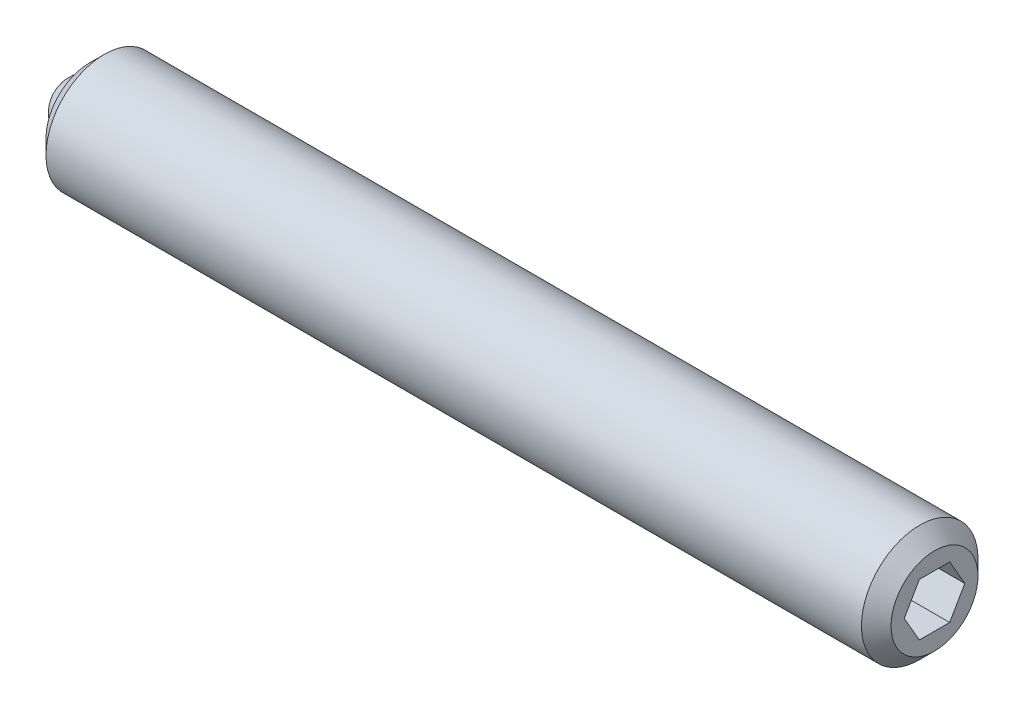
from build123d import *

# Parameters (mm, degrees)
SKETCH2_R           = 1
BOSS_EXTRUDE1_DEPTH = 14.5
CHAMFER1_SIZE       = 0.254
CHAMFER2_SIZE       = 0.254
CUT_EXTRUDE2_DEPTH  = 2
SKETCH3_R           = 0.5
CUT_EXTRUDE3_DEPTH  = 0.5


with BuildPart() as part:
    # Sketch2 → Boss-Extrude1 (new body)
    with BuildSketch(Plane(origin=(0, 0, 0), x_dir=(0, 0, -1), z_dir=(1, 0, 0))):
        with Locations(Location((0, 0, 0), (0, 0, 180))):
            Circle(SKETCH2_R)
    extrude(amount=BOSS_EXTRUDE1_DEPTH)

    # Chamfer1
    chamfer1_edges = [part.edges().sort_by_distance(p)[0] for p in [
        (0, 0, -1),
    ]]
    chamfer(chamfer1_edges, length=CHAMFER1_SIZE)

    # Chamfer2
    chamfer2_edges = [part.edges().sort_by_distance(p)[0] for p in [
        (14.5, 0, -1),
    ]]
    chamfer(chamfer2_edges, length=CHAMFER2_SIZE)

    # Sketch4 → Cut-Extrude2 (cut)
    with BuildSketch(Plane(origin=(14.5, 0, 0), x_dir=(0, 0, -1), z_dir=(1, 0, 0))):
        Polygon((0.519615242, 0), (0.259807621, 0.45), (-0.259807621, 0.45), (-0.519615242, 0), (-0.259807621, -0.45), (0.259807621, -0.45), align=None)
    extrude(amount=-CUT_EXTRUDE2_DEPTH, mode=Mode.SUBTRACT)

    # Sketch3 → Cut-Extrude3 (cut)
    with BuildSketch(Plane.ZY):
        Circle(SKETCH3_R)
    extrude(amount=-CUT_EXTRUDE3_DEPTH, mode=Mode.SUBTRACT)


with BuildPart() as body_2:
    # Sketch5 → Revolve1 (revolve)
    with BuildSketch(Plane.ZY):
        with BuildLine():
            Line((0, 0), (0, -0.5))
            ThreePointArc((0, -0.5), (-0.5, 0), (0, 0.5))
            Line((0, 0.5), (0, 0))
        make_face()
    revolve(axis=Axis((0, 0, 0), (0, 1, 0)))


solid = Compound([part.part, body_2.part])
